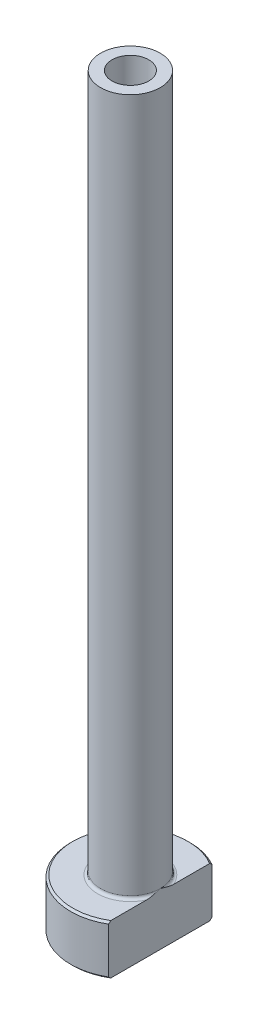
ISO-10303-21;
HEADER;
FILE_DESCRIPTION(('STEP AP214'),'2;1');
FILE_NAME('part.step','',(''),(''),'','','');
FILE_SCHEMA(('AUTOMOTIVE_DESIGN { 1 0 10303 214 1 1 1 1 }'));
ENDSEC;
DATA;
#1=APPLICATION_CONTEXT('core data for automotive mechanical design processes');
#2=APPLICATION_PROTOCOL_DEFINITION('international standard','automotive_design',2000,#1);
#3=PRODUCT_CONTEXT('',#1,'mechanical');
#4=PRODUCT('Part','Part','',(#3));
#5=PRODUCT_RELATED_PRODUCT_CATEGORY('part','',(#4));
#6=PRODUCT_DEFINITION_FORMATION('','',#4);
#7=PRODUCT_DEFINITION_CONTEXT('part definition',#1,'design');
#8=PRODUCT_DEFINITION('design','',#6,#7);
#9=PRODUCT_DEFINITION_SHAPE('','',#8);
#10=(LENGTH_UNIT() NAMED_UNIT(*) SI_UNIT(.MILLI.,.METRE.));
#11=(NAMED_UNIT(*) PLANE_ANGLE_UNIT() SI_UNIT($,.RADIAN.));
#12=(NAMED_UNIT(*) SI_UNIT($,.STERADIAN.) SOLID_ANGLE_UNIT());
#13=UNCERTAINTY_MEASURE_WITH_UNIT(LENGTH_MEASURE(1.E-05),#10,'distance_accuracy_value','');
#14=(GEOMETRIC_REPRESENTATION_CONTEXT(3) GLOBAL_UNCERTAINTY_ASSIGNED_CONTEXT((#13)) GLOBAL_UNIT_ASSIGNED_CONTEXT((#10,
#11,#12)) REPRESENTATION_CONTEXT('',''));
#15=CARTESIAN_POINT('',(0.,0.,0.));
#16=DIRECTION('',(0.,0.,1.));
#17=DIRECTION('',(1.,0.,0.));
#18=AXIS2_PLACEMENT_3D('',#15,#16,#17);
#19=CARTESIAN_POINT('',(0.,92.1876809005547,0.));
#20=DIRECTION('',(0.,1.,0.));
#21=DIRECTION('',(0.,0.,1.));
#22=AXIS2_PLACEMENT_3D('',#19,#20,#21);
#23=CYLINDRICAL_SURFACE('',#22,1.85000000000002);
#24=CARTESIAN_POINT('',(0.,75.,0.));
#25=DIRECTION('',(0.,1.,0.));
#26=DIRECTION('',(0.,0.,1.));
#27=AXIS2_PLACEMENT_3D('',#24,#25,#26);
#28=CIRCLE('',#27,1.85000000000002);
#29=CARTESIAN_POINT('',(0.,75.,1.85000000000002));
#30=VERTEX_POINT('',#29);
#31=EDGE_CURVE('E167',#30,#30,#28,.T.);
#32=ORIENTED_EDGE('',*,*,#31,.T.);
#33=EDGE_LOOP('',(#32));
#34=FACE_BOUND('',#33,.T.);
#35=CARTESIAN_POINT('',(0.,30.,0.));
#36=DIRECTION('',(0.,1.,0.));
#37=DIRECTION('',(0.,0.,1.));
#38=AXIS2_PLACEMENT_3D('',#35,#36,#37);
#39=CIRCLE('',#38,1.85000000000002);
#40=CARTESIAN_POINT('',(0.,30.,1.85000000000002));
#41=VERTEX_POINT('',#40);
#42=EDGE_CURVE('E170',#41,#41,#39,.T.);
#43=ORIENTED_EDGE('',*,*,#42,.F.);
#44=EDGE_LOOP('',(#43));
#45=FACE_BOUND('',#44,.T.);
#46=ADVANCED_FACE('F32',(#34,#45),#23,.F.);
#47=CARTESIAN_POINT('',(-1.85000000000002,75.,0.));
#48=DIRECTION('',(0.,1.,0.));
#49=DIRECTION('',(0.,0.,1.));
#50=AXIS2_PLACEMENT_3D('',#47,#48,#49);
#51=PLANE('',#50);
#52=CARTESIAN_POINT('',(0.,75.,0.));
#53=DIRECTION('',(0.,1.,0.));
#54=DIRECTION('',(0.,0.,1.));
#55=AXIS2_PLACEMENT_3D('',#52,#53,#54);
#56=CIRCLE('',#55,3.);
#57=CARTESIAN_POINT('',(0.,75.,3.));
#58=VERTEX_POINT('',#57);
#59=EDGE_CURVE('E174',#58,#58,#56,.T.);
#60=ORIENTED_EDGE('',*,*,#59,.T.);
#61=EDGE_LOOP('',(#60));
#62=FACE_BOUND('',#61,.T.);
#63=ORIENTED_EDGE('',*,*,#31,.F.);
#64=EDGE_LOOP('',(#63));
#65=FACE_BOUND('',#64,.T.);
#66=ADVANCED_FACE('F157',(#62,#65),#51,.T.);
#67=CARTESIAN_POINT('',(0.,92.1876809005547,0.));
#68=DIRECTION('',(0.,1.,0.));
#69=DIRECTION('',(0.,0.,1.));
#70=AXIS2_PLACEMENT_3D('',#67,#68,#69);
#71=CYLINDRICAL_SURFACE('',#70,2.99999999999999);
#72=CARTESIAN_POINT('',(0.,5.3,0.));
#73=DIRECTION('',(0.,1.,0.));
#74=DIRECTION('',(0.,0.,1.));
#75=AXIS2_PLACEMENT_3D('',#72,#73,#74);
#76=CIRCLE('',#75,2.99999999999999);
#77=CARTESIAN_POINT('',(2.99999999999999,5.3,0.));
#78=VERTEX_POINT('',#77);
#79=EDGE_CURVE('E180',#78,#78,#76,.T.);
#80=ORIENTED_EDGE('',*,*,#79,.T.);
#81=EDGE_LOOP('',(#80));
#82=FACE_BOUND('',#81,.T.);
#83=ORIENTED_EDGE('',*,*,#59,.F.);
#84=EDGE_LOOP('',(#83));
#85=FACE_BOUND('',#84,.T.);
#86=ADVANCED_FACE('F162',(#82,#85),#71,.T.);
#87=CARTESIAN_POINT('',(-2.99999999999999,5.,0.));
#88=DIRECTION('',(0.,1.,0.));
#89=DIRECTION('',(0.,0.,1.));
#90=AXIS2_PLACEMENT_3D('',#87,#88,#89);
#91=PLANE('',#90);
#92=DIRECTION('',(0.,0.,1.));
#93=VECTOR('',#92,1.);
#94=CARTESIAN_POINT('',(3.,5.,0.));
#95=LINE('',#94,#93);
#96=CARTESIAN_POINT('',(3.,5.,-4.96386945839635));
#97=VERTEX_POINT('',#96);
#98=CARTESIAN_POINT('',(3.,5.,-1.37477270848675));
#99=VERTEX_POINT('',#98);
#100=EDGE_CURVE('E54',#97,#99,#95,.T.);
#101=ORIENTED_EDGE('',*,*,#100,.F.);
#102=CARTESIAN_POINT('',(0.,5.,0.));
#103=DIRECTION('',(0.,1.,0.));
#104=DIRECTION('',(0.,0.,1.));
#105=AXIS2_PLACEMENT_3D('',#102,#103,#104);
#106=CIRCLE('',#105,5.80000000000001);
#107=CARTESIAN_POINT('',(2.99999999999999,5.,4.96386945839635));
#108=VERTEX_POINT('',#107);
#109=EDGE_CURVE('E186',#97,#108,#106,.T.);
#110=ORIENTED_EDGE('',*,*,#109,.T.);
#111=CARTESIAN_POINT('',(3.,5.,1.37477270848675));
#112=VERTEX_POINT('',#111);
#113=EDGE_CURVE('E134',#112,#108,#95,.T.);
#114=ORIENTED_EDGE('',*,*,#113,.F.);
#115=CARTESIAN_POINT('',(0.,5.,0.));
#116=DIRECTION('',(0.,1.,0.));
#117=DIRECTION('',(0.,0.,1.));
#118=AXIS2_PLACEMENT_3D('',#115,#116,#117);
#119=CIRCLE('',#118,3.29999999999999);
#120=EDGE_CURVE('E183',#112,#99,#119,.F.);
#121=ORIENTED_EDGE('',*,*,#120,.T.);
#122=EDGE_LOOP('',(#101,#110,#114,#121));
#123=FACE_BOUND('',#122,.T.);
#124=ADVANCED_FACE('F197',(#123),#91,.T.);
#125=CARTESIAN_POINT('',(0.,92.1876809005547,0.));
#126=DIRECTION('',(0.,1.,0.));
#127=DIRECTION('',(0.,0.,1.));
#128=AXIS2_PLACEMENT_3D('',#125,#126,#127);
#129=CYLINDRICAL_SURFACE('',#128,5.99999999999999);
#130=DIRECTION('',(0.,-1.,0.));
#131=VECTOR('',#130,1.);
#132=CARTESIAN_POINT('',(2.99999999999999,75.,5.19615242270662));
#133=LINE('',#132,#131);
#134=CARTESIAN_POINT('',(2.99999999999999,4.8,5.19615242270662));
#135=VERTEX_POINT('',#134);
#136=CARTESIAN_POINT('',(2.99999999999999,0.199999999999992,5.19615242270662));
#137=VERTEX_POINT('',#136);
#138=EDGE_CURVE('E82',#135,#137,#133,.T.);
#139=ORIENTED_EDGE('',*,*,#138,.F.);
#140=CARTESIAN_POINT('',(0.,4.8,0.));
#141=DIRECTION('',(0.,1.,0.));
#142=DIRECTION('',(0.,0.,1.));
#143=AXIS2_PLACEMENT_3D('',#140,#141,#142);
#144=CIRCLE('',#143,5.99999999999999);
#145=CARTESIAN_POINT('',(3.,4.8,-5.19615242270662));
#146=VERTEX_POINT('',#145);
#147=EDGE_CURVE('E95',#135,#146,#144,.F.);
#148=ORIENTED_EDGE('',*,*,#147,.T.);
#149=DIRECTION('',(0.,-1.,0.));
#150=VECTOR('',#149,1.);
#151=CARTESIAN_POINT('',(3.,75.,-5.19615242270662));
#152=LINE('',#151,#150);
#153=CARTESIAN_POINT('',(3.,0.199999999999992,-5.19615242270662));
#154=VERTEX_POINT('',#153);
#155=EDGE_CURVE('E192',#146,#154,#152,.T.);
#156=ORIENTED_EDGE('',*,*,#155,.T.);
#157=CARTESIAN_POINT('',(0.,0.199999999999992,0.));
#158=DIRECTION('',(0.,-1.,0.));
#159=DIRECTION('',(0.,0.,-1.));
#160=AXIS2_PLACEMENT_3D('',#157,#158,#159);
#161=CIRCLE('',#160,5.99999999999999);
#162=EDGE_CURVE('E98',#154,#137,#161,.F.);
#163=ORIENTED_EDGE('',*,*,#162,.T.);
#164=EDGE_LOOP('',(#139,#148,#156,#163));
#165=FACE_BOUND('',#164,.T.);
#166=ADVANCED_FACE('F190',(#165),#129,.T.);
#167=CARTESIAN_POINT('',(-5.99999999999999,0.,0.));
#168=DIRECTION('',(0.,-1.,0.));
#169=DIRECTION('',(0.,0.,-1.));
#170=AXIS2_PLACEMENT_3D('',#167,#168,#169);
#171=PLANE('',#170);
#172=CARTESIAN_POINT('',(0.,0.,0.));
#173=DIRECTION('',(0.,-1.,0.));
#174=DIRECTION('',(0.,0.,-1.));
#175=AXIS2_PLACEMENT_3D('',#172,#173,#174);
#176=CIRCLE('',#175,2.59999999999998);
#177=CARTESIAN_POINT('',(0.,0.,-2.59999999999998));
#178=VERTEX_POINT('',#177);
#179=EDGE_CURVE('E40',#178,#178,#176,.F.);
#180=ORIENTED_EDGE('',*,*,#179,.T.);
#181=EDGE_LOOP('',(#180));
#182=FACE_BOUND('',#181,.T.);
#183=DIRECTION('',(0.,0.,-1.));
#184=VECTOR('',#183,1.);
#185=CARTESIAN_POINT('',(2.99999999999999,0.,5.19615242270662));
#186=LINE('',#185,#184);
#187=CARTESIAN_POINT('',(2.99999999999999,0.,4.96386945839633));
#188=VERTEX_POINT('',#187);
#189=CARTESIAN_POINT('',(3.,0.,-4.96386945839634));
#190=VERTEX_POINT('',#189);
#191=EDGE_CURVE('E47',#188,#190,#186,.T.);
#192=ORIENTED_EDGE('',*,*,#191,.F.);
#193=CARTESIAN_POINT('',(0.,0.,0.));
#194=DIRECTION('',(0.,-1.,0.));
#195=DIRECTION('',(0.,0.,-1.));
#196=AXIS2_PLACEMENT_3D('',#193,#194,#195);
#197=CIRCLE('',#196,5.79999999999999);
#198=EDGE_CURVE('E92',#188,#190,#197,.T.);
#199=ORIENTED_EDGE('',*,*,#198,.T.);
#200=EDGE_LOOP('',(#192,#199));
#201=FACE_BOUND('',#200,.T.);
#202=ADVANCED_FACE('F91',(#182,#201),#171,.T.);
#203=CARTESIAN_POINT('',(0.,92.1876809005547,0.));
#204=DIRECTION('',(0.,1.,0.));
#205=DIRECTION('',(0.,0.,1.));
#206=AXIS2_PLACEMENT_3D('',#203,#204,#205);
#207=CYLINDRICAL_SURFACE('',#206,2.09999999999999);
#208=CARTESIAN_POINT('',(0.,0.499999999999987,0.));
#209=DIRECTION('',(0.,-1.,0.));
#210=DIRECTION('',(0.,0.,-1.));
#211=AXIS2_PLACEMENT_3D('',#208,#209,#210);
#212=CIRCLE('',#211,2.09999999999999);
#213=CARTESIAN_POINT('',(0.,0.499999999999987,-2.09999999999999));
#214=VERTEX_POINT('',#213);
#215=EDGE_CURVE('E11',#214,#214,#212,.T.);
#216=ORIENTED_EDGE('',*,*,#215,.T.);
#217=EDGE_LOOP('',(#216));
#218=FACE_BOUND('',#217,.T.);
#219=CARTESIAN_POINT('',(0.,18.,0.));
#220=DIRECTION('',(0.,1.,0.));
#221=DIRECTION('',(0.,0.,1.));
#222=AXIS2_PLACEMENT_3D('',#219,#220,#221);
#223=CIRCLE('',#222,2.09999999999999);
#224=CARTESIAN_POINT('',(0.,18.,2.09999999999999));
#225=VERTEX_POINT('',#224);
#226=EDGE_CURVE('E172',#225,#225,#223,.T.);
#227=ORIENTED_EDGE('',*,*,#226,.T.);
#228=EDGE_LOOP('',(#227));
#229=FACE_BOUND('',#228,.T.);
#230=ADVANCED_FACE('F215',(#218,#229),#207,.F.);
#231=CARTESIAN_POINT('',(0.,18.,0.));
#232=DIRECTION('',(0.,-1.,0.));
#233=DIRECTION('',(0.,0.,-1.));
#234=AXIS2_PLACEMENT_3D('',#231,#232,#233);
#235=CONICAL_SURFACE('',#234,2.09999999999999,0.0208303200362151);
#236=ORIENTED_EDGE('',*,*,#42,.T.);
#237=EDGE_LOOP('',(#236));
#238=FACE_BOUND('',#237,.T.);
#239=ORIENTED_EDGE('',*,*,#226,.F.);
#240=EDGE_LOOP('',(#239));
#241=FACE_BOUND('',#240,.T.);
#242=ADVANCED_FACE('F111',(#238,#241),#235,.F.);
#243=CARTESIAN_POINT('',(0.,5.3,0.));
#244=DIRECTION('',(0.,1.,0.));
#245=DIRECTION('',(0.,0.,1.));
#246=AXIS2_PLACEMENT_3D('',#243,#244,#245);
#247=TOROIDAL_SURFACE('',#246,3.29999999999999,0.3);
#248=ORIENTED_EDGE('',*,*,#120,.F.);
#249=CARTESIAN_POINT('',(2.99999999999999,5.3,0.));
#250=CARTESIAN_POINT('',(2.99999999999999,5.30000062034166,-1.12611322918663E-10));
#251=CARTESIAN_POINT('',(2.99999999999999,5.30000124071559,1.79706747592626E-07));
#252=CARTESIAN_POINT('',(2.99999999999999,5.30000241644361,7.12597407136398E-07));
#253=CARTESIAN_POINT('',(2.99999999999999,5.30000296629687,1.07470890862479E-06));
#254=CARTESIAN_POINT('',(2.99999999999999,5.30000408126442,1.93940797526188E-06));
#255=CARTESIAN_POINT('',(2.99999999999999,5.30000463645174,2.45488582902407E-06));
#256=CARTESIAN_POINT('',(2.99999999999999,5.30000565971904,3.54465510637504E-06));
#257=CARTESIAN_POINT('',(2.99999999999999,5.30000612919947,4.11770655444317E-06));
#258=CARTESIAN_POINT('',(2.99999999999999,5.30000778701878,6.25396418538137E-06));
#259=CARTESIAN_POINT('',(2.99999999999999,5.30000888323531,7.89070810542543E-06));
#260=CARTESIAN_POINT('',(2.99999999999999,5.30001076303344,1.11998048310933E-05));
#261=CARTESIAN_POINT('',(2.99999999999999,5.30001156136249,1.28642107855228E-05));
#262=CARTESIAN_POINT('',(2.99999999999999,5.3000147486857,1.96537163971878E-05));
#263=CARTESIAN_POINT('',(2.99999999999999,5.30001702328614,2.48380228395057E-05));
#264=CARTESIAN_POINT('',(2.99999999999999,5.30002052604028,3.48178470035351E-05));
#265=CARTESIAN_POINT('',(2.99999999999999,5.30002184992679,3.9580061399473E-05));
#266=CARTESIAN_POINT('',(2.99999999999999,5.30003122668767,7.41814357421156E-05));
#267=CARTESIAN_POINT('',(2.99999999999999,5.30003808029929,0.000104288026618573));
#268=CARTESIAN_POINT('',(2.99999999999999,5.30006804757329,0.00022223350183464));
#269=CARTESIAN_POINT('',(2.99999999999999,5.300096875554,0.000308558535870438));
#270=CARTESIAN_POINT('',(2.99999999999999,5.30020809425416,0.000648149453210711));
#271=CARTESIAN_POINT('',(2.99999999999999,5.30028657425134,0.000902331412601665));
#272=CARTESIAN_POINT('',(2.99999999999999,5.30059876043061,0.00190491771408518));
#273=CARTESIAN_POINT('',(2.99999999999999,5.30083723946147,0.00265218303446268));
#274=CARTESIAN_POINT('',(2.99999999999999,5.3018219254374,0.00574694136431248));
#275=CARTESIAN_POINT('',(2.99999999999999,5.30256224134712,0.00809584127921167));
#276=CARTESIAN_POINT('',(2.99999999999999,5.31160267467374,0.0367678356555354));
#277=CARTESIAN_POINT('',(2.99999999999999,5.31993817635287,0.0630827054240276));
#278=CARTESIAN_POINT('',(2.99999999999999,5.33621504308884,0.114704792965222));
#279=CARTESIAN_POINT('',(2.99999999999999,5.34415908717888,0.140011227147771));
#280=CARTESIAN_POINT('',(2.99999999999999,5.36094382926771,0.193774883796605));
#281=CARTESIAN_POINT('',(2.99999999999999,5.36977415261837,0.222235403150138));
#282=CARTESIAN_POINT('',(2.99999999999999,5.38736474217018,0.2795124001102));
#283=CARTESIAN_POINT('',(2.99999999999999,5.39612323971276,0.308329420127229));
#284=CARTESIAN_POINT('',(2.99999999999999,5.41726575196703,0.37888037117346));
#285=CARTESIAN_POINT('',(2.99999999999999,5.42952723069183,0.420651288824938));
#286=CARTESIAN_POINT('',(2.99999999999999,5.45309597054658,0.503357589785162));
#287=CARTESIAN_POINT('',(2.99999999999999,5.46441924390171,0.544288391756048));
#288=CARTESIAN_POINT('',(2.99999999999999,5.4877816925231,0.632156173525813));
#289=CARTESIAN_POINT('',(2.99999999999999,5.49969678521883,0.679126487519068));
#290=CARTESIAN_POINT('',(2.99999999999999,5.52221484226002,0.773740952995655));
#291=CARTESIAN_POINT('',(2.99999999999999,5.532807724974,0.821387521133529));
#292=CARTESIAN_POINT('',(2.99999999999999,5.55291503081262,0.92058914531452));
#293=CARTESIAN_POINT('',(2.99999999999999,5.56229188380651,0.972172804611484));
#294=CARTESIAN_POINT('',(2.99999999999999,5.57838694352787,1.07574836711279));
#295=CARTESIAN_POINT('',(2.99999999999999,5.58510535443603,1.12774023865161));
#296=CARTESIAN_POINT('',(2.99999999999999,5.59681427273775,1.24924411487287));
#297=CARTESIAN_POINT('',(2.99999999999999,5.60051317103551,1.31890364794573));
#298=CARTESIAN_POINT('',(2.99999999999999,5.59966579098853,1.42270835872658));
#299=CARTESIAN_POINT('',(2.99999999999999,5.59835823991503,1.45688093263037));
#300=CARTESIAN_POINT('',(2.99999999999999,5.59322745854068,1.52502533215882));
#301=CARTESIAN_POINT('',(2.99999999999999,5.58940645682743,1.55899730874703));
#302=CARTESIAN_POINT('',(2.99999999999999,5.57976146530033,1.61947815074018));
#303=CARTESIAN_POINT('',(2.99999999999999,5.57451506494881,1.64607760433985));
#304=CARTESIAN_POINT('',(2.99999999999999,5.56161153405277,1.69883648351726));
#305=CARTESIAN_POINT('',(2.99999999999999,5.55394338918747,1.72499331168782));
#306=CARTESIAN_POINT('',(2.99999999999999,5.53555176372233,1.77650913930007));
#307=CARTESIAN_POINT('',(2.99999999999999,5.52480031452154,1.80185836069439));
#308=CARTESIAN_POINT('',(2.99999999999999,5.49948027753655,1.85054545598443));
#309=CARTESIAN_POINT('',(2.99999999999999,5.48493141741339,1.87389291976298));
#310=CARTESIAN_POINT('',(2.99999999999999,5.45992470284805,1.9055213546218));
#311=CARTESIAN_POINT('',(2.99999999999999,5.45133318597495,1.91527363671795));
#312=CARTESIAN_POINT('',(2.99999999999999,5.43294163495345,1.93360072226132));
#313=CARTESIAN_POINT('',(2.99999999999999,5.42314083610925,1.94217477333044));
#314=CARTESIAN_POINT('',(2.99999999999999,5.40215892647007,1.95778354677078));
#315=CARTESIAN_POINT('',(2.99999999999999,5.39096156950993,1.96479687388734));
#316=CARTESIAN_POINT('',(2.99999999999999,5.36742144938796,1.97652218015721));
#317=CARTESIAN_POINT('',(2.99999999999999,5.35508207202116,1.98124071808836));
#318=CARTESIAN_POINT('',(2.99999999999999,5.33320117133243,1.98690185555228));
#319=CARTESIAN_POINT('',(2.99999999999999,5.32383559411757,1.98852953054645));
#320=CARTESIAN_POINT('',(2.99999999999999,5.30496375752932,1.99016898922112));
#321=CARTESIAN_POINT('',(2.99999999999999,5.29545756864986,1.99018155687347));
#322=CARTESIAN_POINT('',(2.99999999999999,5.27659318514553,1.98858978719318));
#323=CARTESIAN_POINT('',(2.99999999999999,5.26723486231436,1.98698693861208));
#324=CARTESIAN_POINT('',(2.99999999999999,5.24889957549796,1.98229727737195));
#325=CARTESIAN_POINT('',(2.99999999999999,5.23992286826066,1.97920948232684));
#326=CARTESIAN_POINT('',(2.99999999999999,5.21981293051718,1.97059641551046));
#327=CARTESIAN_POINT('',(2.99999999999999,5.20887713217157,1.96461176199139));
#328=CARTESIAN_POINT('',(2.99999999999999,5.18811536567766,1.95095727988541));
#329=CARTESIAN_POINT('',(2.99999999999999,5.17829177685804,1.94328393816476));
#330=CARTESIAN_POINT('',(2.99999999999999,5.15512177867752,1.92254223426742));
#331=CARTESIAN_POINT('',(2.99999999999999,5.14247568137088,1.90869680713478));
#332=CARTESIAN_POINT('',(2.99999999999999,5.11944595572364,1.87927587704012));
#333=CARTESIAN_POINT('',(2.99999999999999,5.10906527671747,1.86369815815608));
#334=CARTESIAN_POINT('',(2.99999999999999,5.08309609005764,1.81927355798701));
#335=CARTESIAN_POINT('',(2.99999999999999,5.06948546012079,1.78928084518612));
#336=CARTESIAN_POINT('',(2.99999999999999,5.04658664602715,1.7275196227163));
#337=CARTESIAN_POINT('',(2.99999999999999,5.03733582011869,1.69573828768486));
#338=CARTESIAN_POINT('',(2.99999999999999,5.02214318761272,1.63079918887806));
#339=CARTESIAN_POINT('',(2.99999999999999,5.01626537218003,1.59762686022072));
#340=CARTESIAN_POINT('',(2.99999999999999,5.0073400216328,1.53086029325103));
#341=CARTESIAN_POINT('',(2.99999999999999,5.00429797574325,1.49726536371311));
#342=CARTESIAN_POINT('',(2.99999999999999,5.00059037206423,1.43100872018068));
#343=CARTESIAN_POINT('',(2.99999999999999,4.9998534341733,1.39835069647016));
#344=CARTESIAN_POINT('',(2.99999999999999,5.0001932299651,1.3331831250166));
#345=CARTESIAN_POINT('',(2.99999999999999,5.00126261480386,1.3006735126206));
#346=CARTESIAN_POINT('',(2.99999999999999,5.00569854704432,1.22190465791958));
#347=CARTESIAN_POINT('',(2.99999999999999,5.00984986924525,1.17569031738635));
#348=CARTESIAN_POINT('',(2.99999999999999,5.0206087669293,1.08357061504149));
#349=CARTESIAN_POINT('',(2.99999999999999,5.02721586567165,1.03766519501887));
#350=CARTESIAN_POINT('',(2.99999999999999,5.0425809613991,0.945130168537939));
#351=CARTESIAN_POINT('',(2.99999999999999,5.05138514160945,0.898508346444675));
#352=CARTESIAN_POINT('',(2.99999999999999,5.07066869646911,0.805496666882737));
#353=CARTESIAN_POINT('',(2.99999999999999,5.08115218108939,0.759107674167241));
#354=CARTESIAN_POINT('',(2.99999999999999,5.10738921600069,0.650207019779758));
#355=CARTESIAN_POINT('',(2.99999999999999,5.12369110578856,0.587828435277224));
#356=CARTESIAN_POINT('',(2.99999999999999,5.15777680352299,0.464212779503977));
#357=CARTESIAN_POINT('',(2.99999999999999,5.17554263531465,0.40297066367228));
#358=CARTESIAN_POINT('',(2.99999999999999,5.21006724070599,0.287596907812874));
#359=CARTESIAN_POINT('',(2.99999999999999,5.22671796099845,0.233432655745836));
#360=CARTESIAN_POINT('',(2.99999999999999,5.2524122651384,0.150940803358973));
#361=CARTESIAN_POINT('',(2.99999999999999,5.26131063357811,0.122567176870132));
#362=CARTESIAN_POINT('',(2.99999999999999,5.27905176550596,0.0662804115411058));
#363=CARTESIAN_POINT('',(2.99999999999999,5.28789327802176,0.0383669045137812));
#364=CARTESIAN_POINT('',(2.99999999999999,5.29743877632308,0.0080925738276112));
#365=CARTESIAN_POINT('',(2.99999999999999,5.29818012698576,0.00574041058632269));
#366=CARTESIAN_POINT('',(2.99999999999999,5.29916506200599,0.00264489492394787));
#367=CARTESIAN_POINT('',(2.99999999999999,5.29940274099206,0.00190013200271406));
#368=CARTESIAN_POINT('',(2.99999999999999,5.29971394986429,0.00090068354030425));
#369=CARTESIAN_POINT('',(2.99999999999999,5.29979223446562,0.000647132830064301));
#370=CARTESIAN_POINT('',(2.99999999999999,5.29990321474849,0.000308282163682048));
#371=CARTESIAN_POINT('',(2.99999999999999,5.29993200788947,0.000222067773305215));
#372=CARTESIAN_POINT('',(2.99999999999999,5.29996194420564,0.000104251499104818));
#373=CARTESIAN_POINT('',(2.99999999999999,5.2999687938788,7.41614194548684E-05));
#374=CARTESIAN_POINT('',(2.99999999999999,5.29997816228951,3.9576667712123E-05));
#375=CARTESIAN_POINT('',(2.99999999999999,5.29997948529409,3.48154634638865E-05));
#376=CARTESIAN_POINT('',(2.99999999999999,5.29998298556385,2.48376252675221E-05));
#377=CARTESIAN_POINT('',(2.99999999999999,5.29998525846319,1.96542432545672E-05));
#378=CARTESIAN_POINT('',(2.99999999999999,5.29998844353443,1.28656642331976E-05));
#379=CARTESIAN_POINT('',(2.99999999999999,5.29998924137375,1.12013336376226E-05));
#380=CARTESIAN_POINT('',(2.99999999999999,5.29999112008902,7.89229913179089E-06));
#381=CARTESIAN_POINT('',(2.99999999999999,5.29999221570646,6.25553441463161E-06));
#382=CARTESIAN_POINT('',(2.99999999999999,5.29999387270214,4.11914308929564E-06));
#383=CARTESIAN_POINT('',(2.99999999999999,5.29999434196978,3.54603035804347E-06));
#384=CARTESIAN_POINT('',(2.99999999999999,5.29999536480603,2.45610018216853E-06));
#385=CARTESIAN_POINT('',(2.99999999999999,5.2999959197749,1.940521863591E-06));
#386=CARTESIAN_POINT('',(2.99999999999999,5.29999703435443,1.07558294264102E-06));
#387=CARTESIAN_POINT('',(2.99999999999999,5.29999758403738,7.13339211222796E-07));
#388=CARTESIAN_POINT('',(2.99999999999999,5.29999875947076,1.80121842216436E-07));
#389=CARTESIAN_POINT('',(2.99999999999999,5.29999937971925,1.12600767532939E-10));
#390=CARTESIAN_POINT('',(2.99999999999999,5.3,0.));
#391=B_SPLINE_CURVE_WITH_KNOTS('',3,(#249,#250,#251,#252,#253,#254,#255,#256,#257,#258,#259,
#260,#261,#262,#263,#264,#265,#266,#267,#268,#269,#270,#271,#272,#273,#274,#275,#276,#277,#278,
#279,#280,#281,#282,#283,#284,#285,#286,#287,#288,#289,#290,#291,#292,#293,#294,#295,#296,#297,
#298,#299,#300,#301,#302,#303,#304,#305,#306,#307,#308,#309,#310,#311,#312,#313,#314,#315,#316,
#317,#318,#319,#320,#321,#322,#323,#324,#325,#326,#327,#328,#329,#330,#331,#332,#333,#334,#335,
#336,#337,#338,#339,#340,#341,#342,#343,#344,#345,#346,#347,#348,#349,#350,#351,#352,#353,#354,
#355,#356,#357,#358,#359,#360,#361,#362,#363,#364,#365,#366,#367,#368,#369,#370,#371,#372,#373,
#374,#375,#376,#377,#378,#379,#380,#381,#382,#383,#384,#385,#386,#387,#388,#389,#390),
.UNSPECIFIED.,.T.,.F.,(4,2,2,2,2,2,2,2,2,2,2,2,2,2,2,2,2,2,2,2,2,2,2,2,2,2,2,2,2,2,2,2,2,2,2,2,
2,2,2,2,2,2,2,2,2,2,2,2,2,2,2,2,2,2,2,2,2,2,2,2,2,2,2,2,2,2,2,2,2,2,4),(0.,1.86513976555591E-06,
3.83353453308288E-06,6.09513509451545E-06,8.31560888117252E-06,1.42000739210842E-05,
1.97335549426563E-05,3.66769911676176E-05,5.14858377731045E-05,0.000144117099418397,
0.000416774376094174,0.00121521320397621,0.00356794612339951,0.0109568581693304,
0.0937636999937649,0.173336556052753,0.26273268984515,0.353088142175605,0.483684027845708,
0.611082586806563,0.756439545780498,0.902844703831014,1.06007042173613,1.21728406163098,
1.42611662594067,1.52864191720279,1.63107642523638,1.71232857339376,1.79395571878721,
1.87634808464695,1.95832065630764,1.99722769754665,2.03615946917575,2.07559591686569,
2.11491897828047,2.14330913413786,2.17168550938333,2.20003575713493,2.22840478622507,
2.26559554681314,2.30286442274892,2.35880214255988,2.4148122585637,2.51307007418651,
2.6121551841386,2.71306273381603,2.81416520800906,2.91210427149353,3.00964583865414,
3.14875779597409,3.28784276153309,3.43014232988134,3.57279564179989,3.76617940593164,
3.95746724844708,4.12746077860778,4.21667041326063,4.30450746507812,4.31190664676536,
4.31425150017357,4.3150479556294,4.31532026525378,4.31541284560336,4.31542765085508,
4.31544458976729,4.31545012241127,4.31545600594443,4.31545822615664,4.31546048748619,
4.31546245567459,4.31546432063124),.UNSPECIFIED.);
#392=EDGE_CURVE('E126',#112,#78,#391,.T.);
#393=ORIENTED_EDGE('',*,*,#392,.T.);
#394=ORIENTED_EDGE('',*,*,#79,.F.);
#395=CARTESIAN_POINT('',(2.99999999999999,5.3,0.));
#396=CARTESIAN_POINT('',(2.99999999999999,5.29999937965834,1.12611566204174E-10));
#397=CARTESIAN_POINT('',(2.99999999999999,5.29999875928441,-1.79706747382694E-07));
#398=CARTESIAN_POINT('',(2.99999999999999,5.29999758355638,-7.12597406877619E-07));
#399=CARTESIAN_POINT('',(2.99999999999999,5.29999703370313,-1.07470890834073E-06));
#400=CARTESIAN_POINT('',(2.99999999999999,5.29999591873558,-1.93940797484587E-06));
#401=CARTESIAN_POINT('',(2.99999999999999,5.29999536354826,-2.45488582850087E-06));
#402=CARTESIAN_POINT('',(2.99999999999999,5.29999434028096,-3.54465510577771E-06));
#403=CARTESIAN_POINT('',(2.99999999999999,5.29999387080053,-4.11770655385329E-06));
#404=CARTESIAN_POINT('',(2.99999999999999,5.29999221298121,-6.25396418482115E-06));
#405=CARTESIAN_POINT('',(2.99999999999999,5.29999111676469,-7.89070810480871E-06));
#406=CARTESIAN_POINT('',(2.99999999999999,5.29998923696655,-1.11998048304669E-05));
#407=CARTESIAN_POINT('',(2.99999999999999,5.2999884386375,-1.28642107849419E-05));
#408=CARTESIAN_POINT('',(2.99999999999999,5.2999852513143,-1.96537163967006E-05));
#409=CARTESIAN_POINT('',(2.99999999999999,5.29998297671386,-2.48380228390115E-05));
#410=CARTESIAN_POINT('',(2.99999999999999,5.29997947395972,-3.4817847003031E-05));
#411=CARTESIAN_POINT('',(2.99999999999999,5.29997815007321,-3.95800613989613E-05));
#412=CARTESIAN_POINT('',(2.99999999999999,5.29996877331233,-7.41814357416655E-05));
#413=CARTESIAN_POINT('',(2.99999999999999,5.2999619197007,-0.000104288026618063));
#414=CARTESIAN_POINT('',(2.99999999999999,5.29993195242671,-0.000222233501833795));
#415=CARTESIAN_POINT('',(2.99999999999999,5.299903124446,-0.000308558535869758));
#416=CARTESIAN_POINT('',(2.99999999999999,5.29979190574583,-0.000648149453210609));
#417=CARTESIAN_POINT('',(2.99999999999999,5.29971342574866,-0.000902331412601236));
#418=CARTESIAN_POINT('',(2.99999999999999,5.29940123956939,-0.00190491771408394));
#419=CARTESIAN_POINT('',(2.99999999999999,5.29916276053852,-0.00265218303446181));
#420=CARTESIAN_POINT('',(2.99999999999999,5.29817807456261,-0.00574694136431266));
#421=CARTESIAN_POINT('',(2.99999999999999,5.29743775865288,-0.00809584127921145));
#422=CARTESIAN_POINT('',(2.99999999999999,5.28839732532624,-0.036767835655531));
#423=CARTESIAN_POINT('',(2.99999999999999,5.28006182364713,-0.0630827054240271));
#424=CARTESIAN_POINT('',(2.99999999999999,5.26378495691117,-0.114704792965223));
#425=CARTESIAN_POINT('',(2.99999999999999,5.25584091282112,-0.140011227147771));
#426=CARTESIAN_POINT('',(2.99999999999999,5.23905617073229,-0.193774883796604));
#427=CARTESIAN_POINT('',(2.99999999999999,5.23022584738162,-0.222235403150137));
#428=CARTESIAN_POINT('',(2.99999999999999,5.21263525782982,-0.279512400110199));
#429=CARTESIAN_POINT('',(2.99999999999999,5.20387676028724,-0.308329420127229));
#430=CARTESIAN_POINT('',(2.99999999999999,5.18273424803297,-0.37888037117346));
#431=CARTESIAN_POINT('',(2.99999999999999,5.17047276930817,-0.420651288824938));
#432=CARTESIAN_POINT('',(2.99999999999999,5.14690402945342,-0.503357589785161));
#433=CARTESIAN_POINT('',(2.99999999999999,5.13558075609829,-0.544288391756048));
#434=CARTESIAN_POINT('',(2.99999999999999,5.1122183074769,-0.632156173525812));
#435=CARTESIAN_POINT('',(2.99999999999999,5.10030321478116,-0.679126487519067));
#436=CARTESIAN_POINT('',(2.99999999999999,5.07778515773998,-0.773740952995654));
#437=CARTESIAN_POINT('',(2.99999999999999,5.067192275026,-0.821387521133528));
#438=CARTESIAN_POINT('',(2.99999999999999,5.04708496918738,-0.920589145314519));
#439=CARTESIAN_POINT('',(2.99999999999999,5.03770811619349,-0.972172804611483));
#440=CARTESIAN_POINT('',(2.99999999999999,5.02161305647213,-1.07574836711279));
#441=CARTESIAN_POINT('',(2.99999999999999,5.01489464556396,-1.12774023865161));
#442=CARTESIAN_POINT('',(2.99999999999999,5.00318572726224,-1.24924411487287));
#443=CARTESIAN_POINT('',(2.99999999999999,4.99948682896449,-1.31890364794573));
#444=CARTESIAN_POINT('',(2.99999999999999,5.00033420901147,-1.42270835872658));
#445=CARTESIAN_POINT('',(2.99999999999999,5.00164176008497,-1.45688093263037));
#446=CARTESIAN_POINT('',(2.99999999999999,5.00677254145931,-1.52502533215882));
#447=CARTESIAN_POINT('',(2.99999999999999,5.01059354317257,-1.55899730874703));
#448=CARTESIAN_POINT('',(2.99999999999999,5.02023853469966,-1.61947815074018));
#449=CARTESIAN_POINT('',(2.99999999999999,5.02548493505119,-1.64607760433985));
#450=CARTESIAN_POINT('',(2.99999999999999,5.03838846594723,-1.69883648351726));
#451=CARTESIAN_POINT('',(2.99999999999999,5.04605661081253,-1.72499331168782));
#452=CARTESIAN_POINT('',(2.99999999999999,5.06444823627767,-1.77650913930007));
#453=CARTESIAN_POINT('',(2.99999999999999,5.07519968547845,-1.80185836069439));
#454=CARTESIAN_POINT('',(2.99999999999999,5.10051972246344,-1.85054545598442));
#455=CARTESIAN_POINT('',(2.99999999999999,5.11506858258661,-1.87389291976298));
#456=CARTESIAN_POINT('',(2.99999999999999,5.14007529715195,-1.9055213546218));
#457=CARTESIAN_POINT('',(2.99999999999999,5.14866681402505,-1.91527363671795));
#458=CARTESIAN_POINT('',(2.99999999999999,5.16705836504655,-1.93360072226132));
#459=CARTESIAN_POINT('',(2.99999999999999,5.17685916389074,-1.94217477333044));
#460=CARTESIAN_POINT('',(2.99999999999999,5.19784107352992,-1.95778354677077));
#461=CARTESIAN_POINT('',(2.99999999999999,5.20903843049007,-1.96479687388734));
#462=CARTESIAN_POINT('',(2.99999999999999,5.23257855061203,-1.97652218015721));
#463=CARTESIAN_POINT('',(2.99999999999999,5.24491792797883,-1.98124071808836));
#464=CARTESIAN_POINT('',(2.99999999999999,5.26679882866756,-1.98690185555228));
#465=CARTESIAN_POINT('',(2.99999999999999,5.27616440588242,-1.98852953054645));
#466=CARTESIAN_POINT('',(2.99999999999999,5.29503624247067,-1.99016898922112));
#467=CARTESIAN_POINT('',(2.99999999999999,5.30454243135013,-1.99018155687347));
#468=CARTESIAN_POINT('',(2.99999999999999,5.32340681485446,-1.98858978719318));
#469=CARTESIAN_POINT('',(2.99999999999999,5.33276513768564,-1.98698693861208));
#470=CARTESIAN_POINT('',(2.99999999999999,5.35110042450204,-1.98229727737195));
#471=CARTESIAN_POINT('',(2.99999999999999,5.36007713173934,-1.97920948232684));
#472=CARTESIAN_POINT('',(2.99999999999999,5.38018706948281,-1.97059641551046));
#473=CARTESIAN_POINT('',(2.99999999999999,5.39112286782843,-1.96461176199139));
#474=CARTESIAN_POINT('',(2.99999999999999,5.41188463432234,-1.95095727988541));
#475=CARTESIAN_POINT('',(2.99999999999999,5.42170822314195,-1.94328393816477));
#476=CARTESIAN_POINT('',(2.99999999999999,5.44487822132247,-1.92254223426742));
#477=CARTESIAN_POINT('',(2.99999999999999,5.45752431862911,-1.90869680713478));
#478=CARTESIAN_POINT('',(2.99999999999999,5.48055404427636,-1.87927587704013));
#479=CARTESIAN_POINT('',(2.99999999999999,5.49093472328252,-1.86369815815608));
#480=CARTESIAN_POINT('',(2.99999999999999,5.51690390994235,-1.81927355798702));
#481=CARTESIAN_POINT('',(2.99999999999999,5.53051453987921,-1.78928084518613));
#482=CARTESIAN_POINT('',(2.99999999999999,5.55341335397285,-1.72751962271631));
#483=CARTESIAN_POINT('',(2.99999999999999,5.56266417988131,-1.69573828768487));
#484=CARTESIAN_POINT('',(2.99999999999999,5.57785681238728,-1.63079918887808));
#485=CARTESIAN_POINT('',(2.99999999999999,5.58373462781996,-1.59762686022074));
#486=CARTESIAN_POINT('',(2.99999999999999,5.59265997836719,-1.53086029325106));
#487=CARTESIAN_POINT('',(2.99999999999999,5.59570202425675,-1.49726536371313));
#488=CARTESIAN_POINT('',(2.99999999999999,5.59940962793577,-1.43100872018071));
#489=CARTESIAN_POINT('',(2.99999999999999,5.6001465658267,-1.39835069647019));
#490=CARTESIAN_POINT('',(2.99999999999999,5.5998067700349,-1.33318312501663));
#491=CARTESIAN_POINT('',(2.99999999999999,5.59873738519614,-1.30067351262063));
#492=CARTESIAN_POINT('',(2.99999999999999,5.59430145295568,-1.22190465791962));
#493=CARTESIAN_POINT('',(2.99999999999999,5.59015013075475,-1.17569031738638));
#494=CARTESIAN_POINT('',(2.99999999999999,5.5793912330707,-1.08357061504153));
#495=CARTESIAN_POINT('',(2.99999999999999,5.57278413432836,-1.0376651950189));
#496=CARTESIAN_POINT('',(2.99999999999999,5.55741903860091,-0.945130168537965));
#497=CARTESIAN_POINT('',(2.99999999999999,5.54861485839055,-0.8985083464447));
#498=CARTESIAN_POINT('',(2.99999999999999,5.52933130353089,-0.805496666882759));
#499=CARTESIAN_POINT('',(2.99999999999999,5.51884781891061,-0.759107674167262));
#500=CARTESIAN_POINT('',(2.99999999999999,5.49261078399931,-0.650207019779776));
#501=CARTESIAN_POINT('',(2.99999999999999,5.47630889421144,-0.58782843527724));
#502=CARTESIAN_POINT('',(2.99999999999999,5.44222319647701,-0.464212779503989));
#503=CARTESIAN_POINT('',(2.99999999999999,5.42445736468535,-0.40297066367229));
#504=CARTESIAN_POINT('',(2.99999999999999,5.38993275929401,-0.287596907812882));
#505=CARTESIAN_POINT('',(2.99999999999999,5.37328203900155,-0.233432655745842));
#506=CARTESIAN_POINT('',(2.99999999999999,5.3475877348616,-0.150940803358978));
#507=CARTESIAN_POINT('',(2.99999999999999,5.33868936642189,-0.122567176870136));
#508=CARTESIAN_POINT('',(2.99999999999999,5.32094823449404,-0.0662804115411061));
#509=CARTESIAN_POINT('',(2.99999999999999,5.31210672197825,-0.0383669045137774));
#510=CARTESIAN_POINT('',(2.99999999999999,5.30256122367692,-0.00809257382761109));
#511=CARTESIAN_POINT('',(2.99999999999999,5.30181987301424,-0.00574041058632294));
#512=CARTESIAN_POINT('',(2.99999999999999,5.300834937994,-0.00264489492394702));
#513=CARTESIAN_POINT('',(2.99999999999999,5.30059725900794,-0.00190013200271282));
#514=CARTESIAN_POINT('',(2.99999999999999,5.30028605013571,-0.000900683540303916));
#515=CARTESIAN_POINT('',(2.99999999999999,5.30020776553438,-0.000647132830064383));
#516=CARTESIAN_POINT('',(2.99999999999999,5.30009678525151,-0.00030828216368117));
#517=CARTESIAN_POINT('',(2.99999999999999,5.30006799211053,-0.000222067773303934));
#518=CARTESIAN_POINT('',(2.99999999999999,5.30003805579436,-0.000104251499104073));
#519=CARTESIAN_POINT('',(2.99999999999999,5.3000312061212,-7.41614194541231E-05));
#520=CARTESIAN_POINT('',(2.99999999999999,5.30002183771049,-3.95766677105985E-05));
#521=CARTESIAN_POINT('',(2.99999999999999,5.30002051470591,-3.48154634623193E-05));
#522=CARTESIAN_POINT('',(2.99999999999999,5.30001701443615,-2.48376252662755E-05));
#523=CARTESIAN_POINT('',(2.99999999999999,5.30001474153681,-1.96542432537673E-05));
#524=CARTESIAN_POINT('',(2.99999999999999,5.30001155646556,-1.28656642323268E-05));
#525=CARTESIAN_POINT('',(2.99999999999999,5.30001075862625,-1.12013336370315E-05));
#526=CARTESIAN_POINT('',(2.99999999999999,5.30000887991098,-7.89229913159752E-06));
#527=CARTESIAN_POINT('',(2.99999999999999,5.30000778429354,-6.25553441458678E-06));
#528=CARTESIAN_POINT('',(2.99999999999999,5.30000612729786,-4.11914308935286E-06));
#529=CARTESIAN_POINT('',(2.99999999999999,5.30000565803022,-3.54603035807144E-06));
#530=CARTESIAN_POINT('',(2.99999999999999,5.30000463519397,-2.4561001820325E-06));
#531=CARTESIAN_POINT('',(2.99999999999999,5.3000040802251,-1.9405218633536E-06));
#532=CARTESIAN_POINT('',(2.99999999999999,5.30000296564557,-1.07558294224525E-06));
#533=CARTESIAN_POINT('',(2.99999999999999,5.30000241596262,-7.13339210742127E-07));
#534=CARTESIAN_POINT('',(2.99999999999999,5.30000124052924,-1.80121841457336E-07));
#535=CARTESIAN_POINT('',(2.99999999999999,5.30000062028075,-1.12600009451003E-10));
#536=CARTESIAN_POINT('',(2.99999999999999,5.3,0.));
#537=B_SPLINE_CURVE_WITH_KNOTS('',3,(#395,#396,#397,#398,#399,#400,#401,#402,#403,#404,#405,
#406,#407,#408,#409,#410,#411,#412,#413,#414,#415,#416,#417,#418,#419,#420,#421,#422,#423,#424,
#425,#426,#427,#428,#429,#430,#431,#432,#433,#434,#435,#436,#437,#438,#439,#440,#441,#442,#443,
#444,#445,#446,#447,#448,#449,#450,#451,#452,#453,#454,#455,#456,#457,#458,#459,#460,#461,#462,
#463,#464,#465,#466,#467,#468,#469,#470,#471,#472,#473,#474,#475,#476,#477,#478,#479,#480,#481,
#482,#483,#484,#485,#486,#487,#488,#489,#490,#491,#492,#493,#494,#495,#496,#497,#498,#499,#500,
#501,#502,#503,#504,#505,#506,#507,#508,#509,#510,#511,#512,#513,#514,#515,#516,#517,#518,#519,
#520,#521,#522,#523,#524,#525,#526,#527,#528,#529,#530,#531,#532,#533,#534,#535,#536),
.UNSPECIFIED.,.T.,.F.,(4,2,2,2,2,2,2,2,2,2,2,2,2,2,2,2,2,2,2,2,2,2,2,2,2,2,2,2,2,2,2,2,2,2,2,2,
2,2,2,2,2,2,2,2,2,2,2,2,2,2,2,2,2,2,2,2,2,2,2,2,2,2,2,2,2,2,2,2,2,2,4),(0.,1.86513976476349E-06,
3.83353453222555E-06,6.09513509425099E-06,8.31560888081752E-06,1.42000739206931E-05,
1.97335549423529E-05,3.66769911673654E-05,5.14858377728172E-05,0.00014411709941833,
0.000416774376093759,0.00121521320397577,0.0035679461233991,0.01095685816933,0.0937636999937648,
0.173336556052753,0.26273268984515,0.353088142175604,0.483684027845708,0.611082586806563,
0.756439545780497,0.902844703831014,1.06007042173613,1.21728406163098,1.42611662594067,
1.52864191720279,1.63107642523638,1.71232857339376,1.79395571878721,1.87634808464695,
1.95832065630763,1.99722769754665,2.03615946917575,2.07559591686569,2.11491897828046,
2.14330913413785,2.17168550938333,2.20003575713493,2.22840478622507,2.26559554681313,
2.30286442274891,2.35880214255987,2.41481225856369,2.5130700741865,2.61215518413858,
2.71306273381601,2.81416520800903,2.91210427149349,3.00964583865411,3.14875779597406,
3.28784276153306,3.43014232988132,3.57279564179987,3.76617940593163,3.95746724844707,
4.12746077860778,4.21667041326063,4.30450746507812,4.31190664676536,4.31425150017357,
4.31504795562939,4.31532026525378,4.31541284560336,4.31542765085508,4.31544458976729,
4.31545012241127,4.31545600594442,4.31545822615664,4.31546048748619,4.31546245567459,
4.31546432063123),.UNSPECIFIED.);
#538=EDGE_CURVE('E135',#78,#99,#537,.T.);
#539=ORIENTED_EDGE('',*,*,#538,.T.);
#540=EDGE_LOOP('',(#248,#393,#394,#539));
#541=FACE_BOUND('',#540,.T.);
#542=ADVANCED_FACE('F141',(#541),#247,.F.);
#543=CARTESIAN_POINT('',(0.,5.,0.));
#544=DIRECTION('',(0.,-1.,0.));
#545=DIRECTION('',(0.,0.,-1.));
#546=AXIS2_PLACEMENT_3D('',#543,#544,#545);
#547=CONICAL_SURFACE('',#546,5.8,0.785398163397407);
#548=CARTESIAN_POINT('',(3.,-1.01993959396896,-11.432889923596));
#549=CARTESIAN_POINT('',(3.,-0.769424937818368,-11.1738796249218));
#550=CARTESIAN_POINT('',(3.,-0.519179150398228,-10.9146084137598));
#551=CARTESIAN_POINT('',(3.,-0.0193842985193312,-10.3953890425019));
#552=CARTESIAN_POINT('',(3.,0.230164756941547,-10.1354408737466));
#553=CARTESIAN_POINT('',(3.,0.728528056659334,-9.61458602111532));
#554=CARTESIAN_POINT('',(3.,0.977341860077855,-9.353678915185));
#555=CARTESIAN_POINT('',(3.,1.47386965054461,-8.83082274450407));
#556=CARTESIAN_POINT('',(3.,1.72158364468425,-8.56887368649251));
#557=CARTESIAN_POINT('',(3.,2.21069282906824,-8.04884148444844));
#558=CARTESIAN_POINT('',(3.,2.45211594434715,-7.79078462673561));
#559=CARTESIAN_POINT('',(3.,2.93315589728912,-7.2729934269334));
#560=CARTESIAN_POINT('',(3.,3.1727727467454,-7.01325909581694));
#561=CARTESIAN_POINT('',(3.,3.64950020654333,-6.49159990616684));
#562=CARTESIAN_POINT('',(3.,3.88661134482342,-6.22967553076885));
#563=CARTESIAN_POINT('',(3.,4.35738571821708,-5.70275148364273));
#564=CARTESIAN_POINT('',(3.,4.5910490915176,-5.43775193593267));
#565=CARTESIAN_POINT('',(3.,4.96416348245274,-5.00636825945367));
#566=CARTESIAN_POINT('',(3.,5.10520133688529,-4.84135845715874));
#567=CARTESIAN_POINT('',(3.,5.38476673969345,-4.50919282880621));
#568=CARTESIAN_POINT('',(3.,5.52329404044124,-4.34203679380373));
#569=CARTESIAN_POINT('',(3.,5.79842961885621,-4.00319933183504));
#570=CARTESIAN_POINT('',(3.,5.93500216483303,-3.83148875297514));
#571=CARTESIAN_POINT('',(3.,6.20336281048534,-3.48442112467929));
#572=CARTESIAN_POINT('',(3.,6.33515205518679,-3.30906496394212));
#573=CARTESIAN_POINT('',(3.,6.59393382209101,-2.95070802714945));
#574=CARTESIAN_POINT('',(2.99999999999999,6.72082315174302,-2.76763161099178));
#575=CARTESIAN_POINT('',(2.99999999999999,6.90336321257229,-2.48771743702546));
#576=CARTESIAN_POINT('',(2.99999999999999,6.96295431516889,-2.3934539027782));
#577=CARTESIAN_POINT('',(2.99999999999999,7.07882720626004,-2.20292146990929));
#578=CARTESIAN_POINT('',(2.99999999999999,7.13510937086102,-2.10665280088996));
#579=CARTESIAN_POINT('',(2.99999999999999,7.24288059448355,-1.91297779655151));
#580=CARTESIAN_POINT('',(2.99999999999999,7.29441986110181,-1.81559978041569));
#581=CARTESIAN_POINT('',(2.99999999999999,7.3924123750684,-1.61833215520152));
#582=CARTESIAN_POINT('',(2.99999999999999,7.4388646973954,-1.51844209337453));
#583=CARTESIAN_POINT('',(2.99999999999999,7.56840030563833,-1.21511948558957));
#584=CARTESIAN_POINT('',(2.99999999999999,7.64209011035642,-1.00730397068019));
#585=CARTESIAN_POINT('',(2.99999999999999,7.72186700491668,-0.695731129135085));
#586=CARTESIAN_POINT('',(2.99999999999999,7.74302901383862,-0.595791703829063));
#587=CARTESIAN_POINT('',(2.99999999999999,7.77582528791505,-0.394325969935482));
#588=CARTESIAN_POINT('',(2.99999999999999,7.78746040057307,-0.292799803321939));
#589=CARTESIAN_POINT('',(2.99999999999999,7.80037895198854,-0.0893987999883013));
#590=CARTESIAN_POINT('',(2.99999999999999,7.80169449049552,0.0124739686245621));
#591=CARTESIAN_POINT('',(2.99999999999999,7.79396363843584,0.21582694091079));
#592=CARTESIAN_POINT('',(2.99999999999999,7.78491639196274,0.317307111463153));
#593=CARTESIAN_POINT('',(2.99999999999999,7.75721241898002,0.518039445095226));
#594=CARTESIAN_POINT('',(2.99999999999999,7.73863812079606,0.61730321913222));
#595=CARTESIAN_POINT('',(2.99999999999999,7.69303955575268,0.813850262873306));
#596=CARTESIAN_POINT('',(2.99999999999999,7.66601427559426,0.911133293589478));
#597=CARTESIAN_POINT('',(2.99999999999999,7.604644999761,1.1039484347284));
#598=CARTESIAN_POINT('',(2.99999999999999,7.57025976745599,1.19946724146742));
#599=CARTESIAN_POINT('',(2.99999999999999,7.49555762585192,1.38810736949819));
#600=CARTESIAN_POINT('',(2.99999999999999,7.45524192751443,1.48122917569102));
#601=CARTESIAN_POINT('',(2.99999999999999,7.36961028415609,1.66561491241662));
#602=CARTESIAN_POINT('',(2.99999999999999,7.32427350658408,1.75686908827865));
#603=CARTESIAN_POINT('',(2.99999999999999,7.22966073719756,1.9373213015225));
#604=CARTESIAN_POINT('',(2.99999999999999,7.18038388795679,2.02651888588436));
#605=CARTESIAN_POINT('',(2.99999999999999,7.02771106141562,2.29153460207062));
#606=CARTESIAN_POINT('',(2.99999999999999,6.91955486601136,2.4646062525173));
#607=CARTESIAN_POINT('',(2.99999999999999,6.69440299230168,2.80577028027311));
#608=CARTESIAN_POINT('',(2.99999999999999,6.57737415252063,2.97384034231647));
#609=CARTESIAN_POINT('',(2.99999999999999,6.33748949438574,3.30561771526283));
#610=CARTESIAN_POINT('',(2.99999999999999,6.21463662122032,3.46932716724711));
#611=CARTESIAN_POINT('',(2.99999999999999,5.96308085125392,3.79561670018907));
#612=CARTESIAN_POINT('',(2.99999999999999,5.83432224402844,3.95815356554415));
#613=CARTESIAN_POINT('',(2.99999999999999,5.5736136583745,4.28066737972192));
#614=CARTESIAN_POINT('',(2.99999999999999,5.44166333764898,4.44064405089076));
#615=CARTESIAN_POINT('',(2.99999999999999,5.17568445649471,4.75819552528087));
#616=CARTESIAN_POINT('',(2.99999999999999,5.04166171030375,4.91577521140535));
#617=CARTESIAN_POINT('',(2.99999999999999,4.7717623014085,5.22934053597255));
#618=CARTESIAN_POINT('',(2.99999999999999,4.63588560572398,5.38532614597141));
#619=CARTESIAN_POINT('',(2.99999999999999,4.27256222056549,5.79849838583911));
#620=CARTESIAN_POINT('',(2.99999999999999,4.04384014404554,6.05456265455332));
#621=CARTESIAN_POINT('',(2.99999999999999,3.58360020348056,6.5641703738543));
#622=CARTESIAN_POINT('',(2.99999999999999,3.35208226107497,6.81771375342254));
#623=CARTESIAN_POINT('',(2.99999999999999,2.88678846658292,7.32315936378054));
#624=CARTESIAN_POINT('',(2.99999999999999,2.65301069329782,7.57505982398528));
#625=CARTESIAN_POINT('',(2.99999999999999,2.18392232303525,8.07742926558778));
#626=CARTESIAN_POINT('',(2.99999999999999,1.94861172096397,8.32789824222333));
#627=CARTESIAN_POINT('',(2.99999999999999,1.48651581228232,8.81743943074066));
#628=CARTESIAN_POINT('',(2.99999999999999,1.25977806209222,9.05655656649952));
#629=CARTESIAN_POINT('',(2.99999999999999,0.80543969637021,9.53397105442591));
#630=CARTESIAN_POINT('',(2.99999999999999,0.577839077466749,9.77226840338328));
#631=CARTESIAN_POINT('',(2.99999999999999,0.12219807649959,10.2479325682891));
#632=CARTESIAN_POINT('',(2.99999999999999,-0.105841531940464,10.4853001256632));
#633=CARTESIAN_POINT('',(2.99999999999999,-0.562491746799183,10.9594816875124));
#634=CARTESIAN_POINT('',(2.99999999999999,-0.791102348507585,11.1962956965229));
#635=CARTESIAN_POINT('',(2.99999999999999,-1.01993959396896,11.432889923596));
#636=B_SPLINE_CURVE_WITH_KNOTS('',3,(#548,#549,#550,#551,#552,#553,#554,#555,#556,#557,#558,
#559,#560,#561,#562,#563,#564,#565,#566,#567,#568,#569,#570,#571,#572,#573,#574,#575,#576,#577,
#578,#579,#580,#581,#582,#583,#584,#585,#586,#587,#588,#589,#590,#591,#592,#593,#594,#595,#596,
#597,#598,#599,#600,#601,#602,#603,#604,#605,#606,#607,#608,#609,#610,#611,#612,#613,#614,#615,
#616,#617,#618,#619,#620,#621,#622,#623,#624,#625,#626,#627,#628,#629,#630,#631,#632,#633,#634,
#635),.UNSPECIFIED.,.F.,.F.,(4,2,2,2,2,2,2,2,2,2,2,2,2,2,2,2,2,2,2,2,2,2,2,2,2,2,2,2,2,2,2,2,2,
2,2,2,2,2,2,2,2,2,2,4),(0.,1.08101662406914,2.16204714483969,3.24363027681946,4.32520642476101,
5.38534462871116,6.445475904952,7.50537917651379,8.56523985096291,9.21643479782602,
9.86769362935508,10.52583232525,11.183812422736,11.8517813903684,12.1862877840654,
12.5207560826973,12.85113322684,13.1815703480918,13.839916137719,14.1460077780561,
14.4520721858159,14.7571841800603,15.0623213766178,15.3648619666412,15.6674388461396,
15.971757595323,16.2760142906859,16.5815843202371,16.88722102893,17.4990577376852,
18.1133060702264,18.7272470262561,19.3492675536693,19.971355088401,20.5919343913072,
21.212524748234,22.2425132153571,23.2725306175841,24.3035181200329,25.3345090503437,
26.3230827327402,27.31166028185,28.2991352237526,29.286602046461),.UNSPECIFIED.);
#637=EDGE_CURVE('E133',#146,#97,#636,.T.);
#638=ORIENTED_EDGE('',*,*,#637,.F.);
#639=ORIENTED_EDGE('',*,*,#147,.F.);
#640=EDGE_CURVE('E118',#108,#135,#636,.T.);
#641=ORIENTED_EDGE('',*,*,#640,.F.);
#642=ORIENTED_EDGE('',*,*,#109,.F.);
#643=EDGE_LOOP('',(#638,#639,#641,#642));
#644=FACE_BOUND('',#643,.T.);
#645=ADVANCED_FACE('F145',(#644),#547,.T.);
#646=CARTESIAN_POINT('',(0.,0.199999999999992,0.));
#647=DIRECTION('',(0.,1.,0.));
#648=DIRECTION('',(0.,0.,1.));
#649=AXIS2_PLACEMENT_3D('',#646,#647,#648);
#650=CONICAL_SURFACE('',#649,5.99999999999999,0.785398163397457);
#651=CARTESIAN_POINT('',(2.99999999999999,6.01993959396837,11.432889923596));
#652=CARTESIAN_POINT('',(2.99999999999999,5.76942493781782,11.1738796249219));
#653=CARTESIAN_POINT('',(2.99999999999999,5.51917915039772,10.9146084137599));
#654=CARTESIAN_POINT('',(2.99999999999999,5.01938429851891,10.395389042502));
#655=CARTESIAN_POINT('',(2.99999999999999,4.76983524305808,10.1354408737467));
#656=CARTESIAN_POINT('',(2.99999999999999,4.27147194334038,9.61458602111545));
#657=CARTESIAN_POINT('',(2.99999999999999,4.0226581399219,9.35367891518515));
#658=CARTESIAN_POINT('',(2.99999999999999,3.52613034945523,8.83082274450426));
#659=CARTESIAN_POINT('',(2.99999999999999,3.27841635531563,8.56887368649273));
#660=CARTESIAN_POINT('',(2.99999999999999,2.78930717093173,8.04884148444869));
#661=CARTESIAN_POINT('',(2.99999999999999,2.54788405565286,7.79078462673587));
#662=CARTESIAN_POINT('',(2.99999999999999,2.06684410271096,7.2729934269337));
#663=CARTESIAN_POINT('',(2.99999999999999,1.82722725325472,7.01325909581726));
#664=CARTESIAN_POINT('',(2.99999999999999,1.35049979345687,6.4915999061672));
#665=CARTESIAN_POINT('',(2.99999999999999,1.11338865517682,6.22967553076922));
#666=CARTESIAN_POINT('',(2.99999999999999,0.642614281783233,5.70275148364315));
#667=CARTESIAN_POINT('',(2.99999999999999,0.408950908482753,5.43775193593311));
#668=CARTESIAN_POINT('',(2.99999999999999,0.035836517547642,5.00636825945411));
#669=CARTESIAN_POINT('',(2.99999999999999,-0.105201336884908,4.84135845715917));
#670=CARTESIAN_POINT('',(2.99999999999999,-0.384766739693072,4.50919282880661));
#671=CARTESIAN_POINT('',(2.99999999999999,-0.523294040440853,4.34203679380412));
#672=CARTESIAN_POINT('',(2.99999999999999,-0.798429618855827,4.00319933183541));
#673=CARTESIAN_POINT('',(2.99999999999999,-0.935002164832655,3.83148875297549));
#674=CARTESIAN_POINT('',(2.99999999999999,-1.20336281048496,3.48442112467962));
#675=CARTESIAN_POINT('',(2.99999999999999,-1.33515205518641,3.30906496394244));
#676=CARTESIAN_POINT('',(2.99999999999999,-1.59393382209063,2.95070802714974));
#677=CARTESIAN_POINT('',(2.99999999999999,-1.72082315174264,2.76763161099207));
#678=CARTESIAN_POINT('',(2.99999999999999,-1.90336321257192,2.48771743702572));
#679=CARTESIAN_POINT('',(2.99999999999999,-1.96295431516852,2.39345390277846));
#680=CARTESIAN_POINT('',(2.99999999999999,-2.07882720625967,2.20292146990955));
#681=CARTESIAN_POINT('',(2.99999999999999,-2.13510937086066,2.10665280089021));
#682=CARTESIAN_POINT('',(2.99999999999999,-2.24288059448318,1.91297779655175));
#683=CARTESIAN_POINT('',(2.99999999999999,-2.29441986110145,1.81559978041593));
#684=CARTESIAN_POINT('',(2.99999999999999,-2.39241237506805,1.61833215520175));
#685=CARTESIAN_POINT('',(2.99999999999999,-2.43886469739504,1.51844209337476));
#686=CARTESIAN_POINT('',(2.99999999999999,-2.56840030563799,1.21511948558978));
#687=CARTESIAN_POINT('',(2.99999999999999,-2.64209011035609,1.00730397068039));
#688=CARTESIAN_POINT('',(2.99999999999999,-2.72186700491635,0.695731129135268));
#689=CARTESIAN_POINT('',(2.99999999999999,-2.74302901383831,0.595791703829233));
#690=CARTESIAN_POINT('',(2.99999999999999,-2.77582528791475,0.394325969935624));
#691=CARTESIAN_POINT('',(2.99999999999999,-2.78746040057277,0.292799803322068));
#692=CARTESIAN_POINT('',(2.99999999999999,-2.80037895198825,0.0893987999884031));
#693=CARTESIAN_POINT('',(2.99999999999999,-2.80169449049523,-0.0124739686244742));
#694=CARTESIAN_POINT('',(2.99999999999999,-2.79396363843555,-0.21582694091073));
#695=CARTESIAN_POINT('',(2.99999999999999,-2.78491639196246,-0.317307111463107));
#696=CARTESIAN_POINT('',(2.99999999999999,-2.75721241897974,-0.518039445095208));
#697=CARTESIAN_POINT('',(2.99999999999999,-2.73863812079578,-0.617303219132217));
#698=CARTESIAN_POINT('',(2.99999999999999,-2.69303955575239,-0.813850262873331));
#699=CARTESIAN_POINT('',(2.99999999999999,-2.66601427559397,-0.911133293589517));
#700=CARTESIAN_POINT('',(2.99999999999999,-2.60464499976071,-1.10394843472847));
#701=CARTESIAN_POINT('',(2.99999999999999,-2.57025976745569,-1.19946724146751));
#702=CARTESIAN_POINT('',(2.99999999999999,-2.49555762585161,-1.3881073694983));
#703=CARTESIAN_POINT('',(2.99999999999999,-2.45524192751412,-1.48122917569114));
#704=CARTESIAN_POINT('',(2.99999999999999,-2.36961028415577,-1.66561491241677));
#705=CARTESIAN_POINT('',(2.99999999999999,-2.32427350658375,-1.75686908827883));
#706=CARTESIAN_POINT('',(2.99999999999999,-2.22966073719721,-1.93732130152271));
#707=CARTESIAN_POINT('',(2.99999999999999,-2.18038388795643,-2.0265188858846));
#708=CARTESIAN_POINT('',(2.99999999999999,-2.02771106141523,-2.29153460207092));
#709=CARTESIAN_POINT('',(3.,-1.91955486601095,-2.46460625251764));
#710=CARTESIAN_POINT('',(3.,-1.69440299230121,-2.80577028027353));
#711=CARTESIAN_POINT('',(3.,-1.57737415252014,-2.97384034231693));
#712=CARTESIAN_POINT('',(3.,-1.33748949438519,-3.30561771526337));
#713=CARTESIAN_POINT('',(3.,-1.21463662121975,-3.4693271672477));
#714=CARTESIAN_POINT('',(3.,-0.963080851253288,-3.79561670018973));
#715=CARTESIAN_POINT('',(3.,-0.834322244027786,-3.95815356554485));
#716=CARTESIAN_POINT('',(3.,-0.573613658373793,-4.2806673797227));
#717=CARTESIAN_POINT('',(3.,-0.441663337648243,-4.44064405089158));
#718=CARTESIAN_POINT('',(3.,-0.175684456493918,-4.75819552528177));
#719=CARTESIAN_POINT('',(3.,-0.0416617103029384,-4.91577521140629));
#720=CARTESIAN_POINT('',(3.,0.22823769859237,-5.22934053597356));
#721=CARTESIAN_POINT('',(3.,0.364114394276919,-5.38532614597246));
#722=CARTESIAN_POINT('',(3.,0.727437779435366,-5.79849838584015));
#723=CARTESIAN_POINT('',(3.,0.956159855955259,-6.0545626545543));
#724=CARTESIAN_POINT('',(3.,1.41639979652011,-6.56417037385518));
#725=CARTESIAN_POINT('',(3.,1.64791773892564,-6.81771375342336));
#726=CARTESIAN_POINT('',(3.,2.11321153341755,-7.32315936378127));
#727=CARTESIAN_POINT('',(3.,2.34698930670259,-7.57505982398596));
#728=CARTESIAN_POINT('',(3.,2.81607767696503,-8.07742926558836));
#729=CARTESIAN_POINT('',(3.,3.05138827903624,-8.32789824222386));
#730=CARTESIAN_POINT('',(3.,3.51348418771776,-8.81743943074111));
#731=CARTESIAN_POINT('',(3.,3.7402219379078,-9.05655656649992));
#732=CARTESIAN_POINT('',(3.,4.19456030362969,-9.53397105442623));
#733=CARTESIAN_POINT('',(3.,4.42216092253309,-9.77226840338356));
#734=CARTESIAN_POINT('',(3.,4.87780192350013,-10.2479325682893));
#735=CARTESIAN_POINT('',(3.,5.10584153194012,-10.4853001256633));
#736=CARTESIAN_POINT('',(3.,5.56249174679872,-10.9594816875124));
#737=CARTESIAN_POINT('',(3.,5.79110234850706,-11.1962956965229));
#738=CARTESIAN_POINT('',(3.,6.01993959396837,-11.432889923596));
#739=B_SPLINE_CURVE_WITH_KNOTS('',3,(#651,#652,#653,#654,#655,#656,#657,#658,#659,#660,#661,
#662,#663,#664,#665,#666,#667,#668,#669,#670,#671,#672,#673,#674,#675,#676,#677,#678,#679,#680,
#681,#682,#683,#684,#685,#686,#687,#688,#689,#690,#691,#692,#693,#694,#695,#696,#697,#698,#699,
#700,#701,#702,#703,#704,#705,#706,#707,#708,#709,#710,#711,#712,#713,#714,#715,#716,#717,#718,
#719,#720,#721,#722,#723,#724,#725,#726,#727,#728,#729,#730,#731,#732,#733,#734,#735,#736,#737,
#738),.UNSPECIFIED.,.F.,.F.,(4,2,2,2,2,2,2,2,2,2,2,2,2,2,2,2,2,2,2,2,2,2,2,2,2,2,2,2,2,2,2,2,2,
2,2,2,2,2,2,2,2,2,2,4),(0.,1.08101662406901,2.16204714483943,3.24363027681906,4.32520642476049,
5.38534462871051,6.44547590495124,7.50537917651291,8.56523985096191,9.21643479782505,
9.86769362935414,10.5258323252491,11.1838124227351,11.8517813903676,12.1862877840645,
12.5207560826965,12.8511332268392,13.181570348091,13.8399161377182,14.1460077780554,
14.4520721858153,14.7571841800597,15.0623213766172,15.3648619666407,15.6674388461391,
15.9717575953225,16.2760142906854,16.5815843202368,16.8872210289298,17.4990577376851,
18.1133060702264,18.7272470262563,19.3492675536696,19.9713550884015,20.5919343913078,
21.2125247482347,22.2425132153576,23.2725306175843,24.3035181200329,25.3345090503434,
26.3230827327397,27.3116602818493,28.2991352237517,29.2866020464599),.UNSPECIFIED.);
#740=EDGE_CURVE('E79',#137,#188,#739,.T.);
#741=ORIENTED_EDGE('',*,*,#740,.F.);
#742=ORIENTED_EDGE('',*,*,#162,.F.);
#743=EDGE_CURVE('E87',#190,#154,#739,.T.);
#744=ORIENTED_EDGE('',*,*,#743,.F.);
#745=ORIENTED_EDGE('',*,*,#198,.F.);
#746=EDGE_LOOP('',(#741,#742,#744,#745));
#747=FACE_BOUND('',#746,.T.);
#748=ADVANCED_FACE('F94',(#747),#650,.T.);
#749=CARTESIAN_POINT('',(2.99999999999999,75.,5.19615242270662));
#750=DIRECTION('',(-1.,0.,0.));
#751=DIRECTION('',(0.,0.,1.));
#752=AXIS2_PLACEMENT_3D('',#749,#750,#751);
#753=PLANE('',#752);
#754=ORIENTED_EDGE('',*,*,#392,.F.);
#755=ORIENTED_EDGE('',*,*,#113,.T.);
#756=ORIENTED_EDGE('',*,*,#640,.T.);
#757=ORIENTED_EDGE('',*,*,#138,.T.);
#758=ORIENTED_EDGE('',*,*,#740,.T.);
#759=ORIENTED_EDGE('',*,*,#191,.T.);
#760=ORIENTED_EDGE('',*,*,#743,.T.);
#761=ORIENTED_EDGE('',*,*,#155,.F.);
#762=ORIENTED_EDGE('',*,*,#637,.T.);
#763=ORIENTED_EDGE('',*,*,#100,.T.);
#764=ORIENTED_EDGE('',*,*,#538,.F.);
#765=EDGE_LOOP('',(#754,#755,#756,#757,#758,#759,#760,#761,#762,#763,#764));
#766=FACE_BOUND('',#765,.T.);
#767=ADVANCED_FACE('F80',(#766),#753,.F.);
#768=CARTESIAN_POINT('',(0.,0.,0.));
#769=DIRECTION('',(0.,-1.,0.));
#770=DIRECTION('',(0.,0.,-1.));
#771=AXIS2_PLACEMENT_3D('',#768,#769,#770);
#772=CONICAL_SURFACE('',#771,2.59999999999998,0.785398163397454);
#773=ORIENTED_EDGE('',*,*,#215,.F.);
#774=EDGE_LOOP('',(#773));
#775=FACE_BOUND('',#774,.T.);
#776=ORIENTED_EDGE('',*,*,#179,.F.);
#777=EDGE_LOOP('',(#776));
#778=FACE_BOUND('',#777,.T.);
#779=ADVANCED_FACE('F34',(#775,#778),#772,.F.);
#780=CLOSED_SHELL('',(#46,#66,#86,#124,#166,#202,#230,#242,#542,#645,#748,#767,#779));
#781=MANIFOLD_SOLID_BREP('B2',#780);
#782=ADVANCED_BREP_SHAPE_REPRESENTATION('',(#18,#781),#14);
#783=SHAPE_DEFINITION_REPRESENTATION(#9,#782);
ENDSEC;
END-ISO-10303-21;
